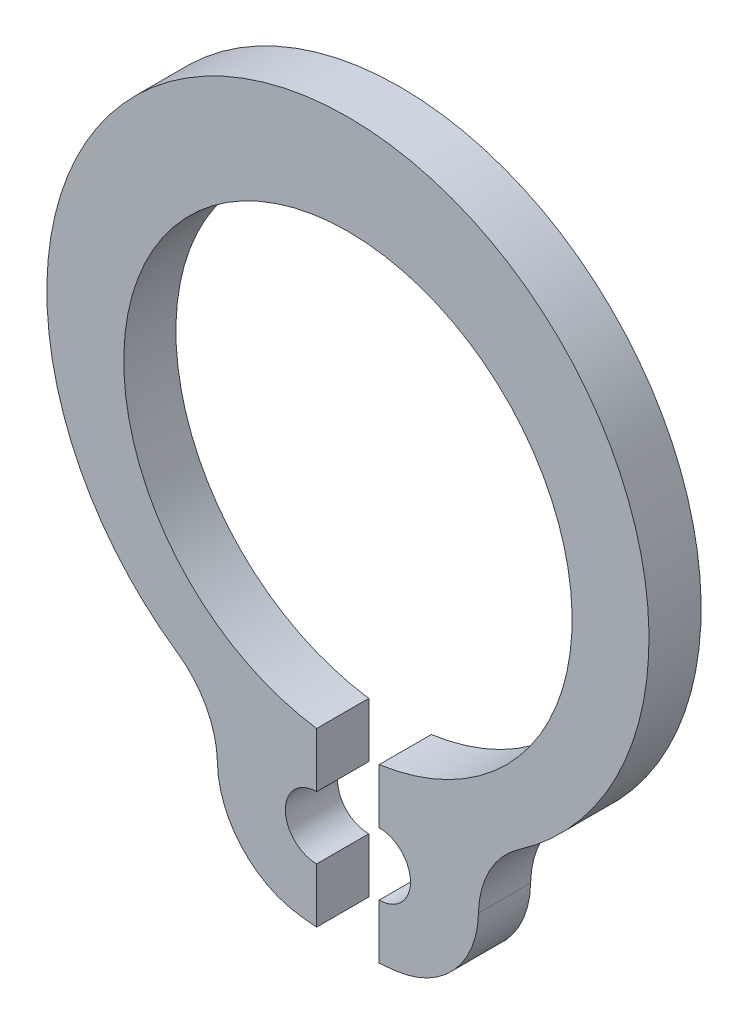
ISO-10303-21;
HEADER;
FILE_DESCRIPTION(('STEP AP214'),'2;1');
FILE_NAME('part.step','',(''),(''),'','','');
FILE_SCHEMA(('AUTOMOTIVE_DESIGN { 1 0 10303 214 1 1 1 1 }'));
ENDSEC;
DATA;
#1=APPLICATION_CONTEXT('core data for automotive mechanical design processes');
#2=APPLICATION_PROTOCOL_DEFINITION('international standard','automotive_design',2000,#1);
#3=PRODUCT_CONTEXT('',#1,'mechanical');
#4=PRODUCT('Part','Part','',(#3));
#5=PRODUCT_RELATED_PRODUCT_CATEGORY('part','',(#4));
#6=PRODUCT_DEFINITION_FORMATION('','',#4);
#7=PRODUCT_DEFINITION_CONTEXT('part definition',#1,'design');
#8=PRODUCT_DEFINITION('design','',#6,#7);
#9=PRODUCT_DEFINITION_SHAPE('','',#8);
#10=(LENGTH_UNIT() NAMED_UNIT(*) SI_UNIT(.MILLI.,.METRE.));
#11=(NAMED_UNIT(*) PLANE_ANGLE_UNIT() SI_UNIT($,.RADIAN.));
#12=(NAMED_UNIT(*) SI_UNIT($,.STERADIAN.) SOLID_ANGLE_UNIT());
#13=UNCERTAINTY_MEASURE_WITH_UNIT(LENGTH_MEASURE(1.E-05),#10,'distance_accuracy_value','');
#14=(GEOMETRIC_REPRESENTATION_CONTEXT(3) GLOBAL_UNCERTAINTY_ASSIGNED_CONTEXT((#13)) GLOBAL_UNIT_ASSIGNED_CONTEXT((#10,
#11,#12)) REPRESENTATION_CONTEXT('',''));
#15=CARTESIAN_POINT('',(0.,0.,0.));
#16=DIRECTION('',(0.,0.,1.));
#17=DIRECTION('',(1.,0.,0.));
#18=AXIS2_PLACEMENT_3D('',#15,#16,#17);
#19=CARTESIAN_POINT('',(0.,-5.55231109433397,0.));
#20=DIRECTION('',(0.,0.,1.));
#21=DIRECTION('',(1.,0.,0.));
#22=AXIS2_PLACEMENT_3D('',#19,#20,#21);
#23=PLANE('',#22);
#24=CARTESIAN_POINT('',(0.,-4.5,0.));
#25=DIRECTION('',(0.,0.,1.));
#26=DIRECTION('',(1.,0.,0.));
#27=AXIS2_PLACEMENT_3D('',#24,#25,#26);
#28=CIRCLE('',#27,7.58171239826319);
#29=CARTESIAN_POINT('',(-0.923332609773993,-12.0252787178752,0.));
#30=VERTEX_POINT('',#29);
#31=CARTESIAN_POINT('',(-0.6,-12.0579337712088,0.));
#32=VERTEX_POINT('',#31);
#33=EDGE_CURVE('E20',#30,#32,#28,.T.);
#34=ORIENTED_EDGE('',*,*,#33,.F.);
#35=CARTESIAN_POINT('',(-0.704121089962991,-10.2386768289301,0.));
#36=DIRECTION('',(0.,0.,1.));
#37=DIRECTION('',(1.,0.,0.));
#38=AXIS2_PLACEMENT_3D('',#35,#36,#37);
#39=CIRCLE('',#38,1.8);
#40=CARTESIAN_POINT('',(-2.50377896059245,-10.2737702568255,0.));
#41=VERTEX_POINT('',#40);
#42=EDGE_CURVE('E119',#41,#30,#39,.T.);
#43=ORIENTED_EDGE('',*,*,#42,.F.);
#44=CARTESIAN_POINT('',(-4.3034368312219,-10.308863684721,0.));
#45=DIRECTION('',(0.,0.,1.));
#46=DIRECTION('',(1.,0.,0.));
#47=AXIS2_PLACEMENT_3D('',#44,#45,#46);
#48=CIRCLE('',#47,1.8);
#49=CARTESIAN_POINT('',(-3.28083798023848,-8.82754954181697,0.));
#50=VERTEX_POINT('',#49);
#51=EDGE_CURVE('E134',#50,#41,#48,.F.);
#52=ORIENTED_EDGE('',*,*,#51,.F.);
#53=CARTESIAN_POINT('',(0.,-4.075,0.));
#54=DIRECTION('',(0.,0.,1.));
#55=DIRECTION('',(1.,0.,0.));
#56=AXIS2_PLACEMENT_3D('',#53,#54,#55);
#57=CIRCLE('',#56,5.775);
#58=CARTESIAN_POINT('',(3.28083798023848,-8.82754954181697,0.));
#59=VERTEX_POINT('',#58);
#60=EDGE_CURVE('E141',#59,#50,#57,.T.);
#61=ORIENTED_EDGE('',*,*,#60,.F.);
#62=CARTESIAN_POINT('',(4.3034368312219,-10.308863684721,0.));
#63=DIRECTION('',(0.,0.,1.));
#64=DIRECTION('',(1.,0.,0.));
#65=AXIS2_PLACEMENT_3D('',#62,#63,#64);
#66=CIRCLE('',#65,1.8);
#67=CARTESIAN_POINT('',(2.50377896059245,-10.2737702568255,0.));
#68=VERTEX_POINT('',#67);
#69=EDGE_CURVE('E144',#68,#59,#66,.F.);
#70=ORIENTED_EDGE('',*,*,#69,.F.);
#71=CARTESIAN_POINT('',(0.704121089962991,-10.2386768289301,0.));
#72=DIRECTION('',(0.,0.,1.));
#73=DIRECTION('',(1.,0.,0.));
#74=AXIS2_PLACEMENT_3D('',#71,#72,#73);
#75=CIRCLE('',#74,1.8);
#76=CARTESIAN_POINT('',(0.923332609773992,-12.0252787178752,0.));
#77=VERTEX_POINT('',#76);
#78=EDGE_CURVE('E147',#77,#68,#75,.T.);
#79=ORIENTED_EDGE('',*,*,#78,.F.);
#80=CARTESIAN_POINT('',(0.,-4.5,0.));
#81=DIRECTION('',(0.,0.,1.));
#82=DIRECTION('',(1.,0.,0.));
#83=AXIS2_PLACEMENT_3D('',#80,#81,#82);
#84=CIRCLE('',#83,7.58171239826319);
#85=CARTESIAN_POINT('',(0.599999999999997,-12.0579337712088,0.));
#86=VERTEX_POINT('',#85);
#87=EDGE_CURVE('E150',#86,#77,#84,.T.);
#88=ORIENTED_EDGE('',*,*,#87,.F.);
#89=DIRECTION('',(0.,-1.,0.));
#90=VECTOR('',#89,1.);
#91=CARTESIAN_POINT('',(0.6,-12.0579337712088,0.));
#92=LINE('',#91,#90);
#93=CARTESIAN_POINT('',(0.6,-11.0079337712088,0.));
#94=VERTEX_POINT('',#93);
#95=EDGE_CURVE('E175',#94,#86,#92,.T.);
#96=ORIENTED_EDGE('',*,*,#95,.F.);
#97=CARTESIAN_POINT('',(0.6,-10.4079337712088,0.));
#98=DIRECTION('',(0.,0.,1.));
#99=DIRECTION('',(1.,0.,0.));
#100=AXIS2_PLACEMENT_3D('',#97,#98,#99);
#101=CIRCLE('',#100,0.6);
#102=CARTESIAN_POINT('',(0.6,-9.80793377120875,0.));
#103=VERTEX_POINT('',#102);
#104=EDGE_CURVE('E153',#103,#94,#101,.F.);
#105=ORIENTED_EDGE('',*,*,#104,.F.);
#106=DIRECTION('',(0.,1.,0.));
#107=VECTOR('',#106,1.);
#108=CARTESIAN_POINT('',(0.6,-9.80793377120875,0.));
#109=LINE('',#108,#107);
#110=CARTESIAN_POINT('',(0.6,-8.75793377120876,0.));
#111=VERTEX_POINT('',#110);
#112=EDGE_CURVE('E177',#111,#103,#109,.F.);
#113=ORIENTED_EDGE('',*,*,#112,.F.);
#114=CARTESIAN_POINT('',(0.,-4.5,0.));
#115=DIRECTION('',(0.,0.,1.));
#116=DIRECTION('',(1.,0.,0.));
#117=AXIS2_PLACEMENT_3D('',#114,#115,#116);
#118=CIRCLE('',#117,4.3);
#119=CARTESIAN_POINT('',(-0.6,-8.75793377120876,0.));
#120=VERTEX_POINT('',#119);
#121=EDGE_CURVE('E157',#120,#111,#118,.F.);
#122=ORIENTED_EDGE('',*,*,#121,.F.);
#123=DIRECTION('',(0.,1.,0.));
#124=VECTOR('',#123,1.);
#125=CARTESIAN_POINT('',(-0.6,-8.75793377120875,0.));
#126=LINE('',#125,#124);
#127=CARTESIAN_POINT('',(-0.6,-9.80793377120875,0.));
#128=VERTEX_POINT('',#127);
#129=EDGE_CURVE('E167',#128,#120,#126,.T.);
#130=ORIENTED_EDGE('',*,*,#129,.F.);
#131=CARTESIAN_POINT('',(-0.6,-10.4079337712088,0.));
#132=DIRECTION('',(0.,0.,1.));
#133=DIRECTION('',(1.,0.,0.));
#134=AXIS2_PLACEMENT_3D('',#131,#132,#133);
#135=CIRCLE('',#134,0.6);
#136=CARTESIAN_POINT('',(-0.6,-11.0079337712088,0.));
#137=VERTEX_POINT('',#136);
#138=EDGE_CURVE('E160',#137,#128,#135,.F.);
#139=ORIENTED_EDGE('',*,*,#138,.F.);
#140=DIRECTION('',(0.,1.,0.));
#141=VECTOR('',#140,1.);
#142=CARTESIAN_POINT('',(-0.6,-11.0079337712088,0.));
#143=LINE('',#142,#141);
#144=EDGE_CURVE('E121',#32,#137,#143,.T.);
#145=ORIENTED_EDGE('',*,*,#144,.F.);
#146=EDGE_LOOP('',(#34,#43,#52,#61,#70,#79,#88,#96,#105,#113,#122,#130,#139,#145));
#147=FACE_BOUND('',#146,.T.);
#148=ADVANCED_FACE('F16',(#147),#23,.F.);
#149=CARTESIAN_POINT('',(0.,-4.5,0.));
#150=DIRECTION('',(0.,0.,1.));
#151=DIRECTION('',(1.,0.,0.));
#152=AXIS2_PLACEMENT_3D('',#149,#150,#151);
#153=CYLINDRICAL_SURFACE('',#152,7.58171239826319);
#154=ORIENTED_EDGE('',*,*,#33,.T.);
#155=DIRECTION('',(0.,0.,-1.));
#156=VECTOR('',#155,1.);
#157=CARTESIAN_POINT('',(-0.6,-12.0579337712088,0.));
#158=LINE('',#157,#156);
#159=CARTESIAN_POINT('',(-0.6,-12.0579337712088,1.));
#160=VERTEX_POINT('',#159);
#161=EDGE_CURVE('E124',#160,#32,#158,.T.);
#162=ORIENTED_EDGE('',*,*,#161,.F.);
#163=CARTESIAN_POINT('',(0.,-4.5,1.));
#164=DIRECTION('',(0.,0.,1.));
#165=DIRECTION('',(1.,0.,0.));
#166=AXIS2_PLACEMENT_3D('',#163,#164,#165);
#167=CIRCLE('',#166,7.58171239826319);
#168=CARTESIAN_POINT('',(-0.923332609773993,-12.0252787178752,1.));
#169=VERTEX_POINT('',#168);
#170=EDGE_CURVE('E129',#169,#160,#167,.T.);
#171=ORIENTED_EDGE('',*,*,#170,.F.);
#172=DIRECTION('',(0.,0.,1.));
#173=VECTOR('',#172,1.);
#174=CARTESIAN_POINT('',(-0.923332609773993,-12.0252787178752,0.));
#175=LINE('',#174,#173);
#176=EDGE_CURVE('E126',#30,#169,#175,.T.);
#177=ORIENTED_EDGE('',*,*,#176,.F.);
#178=EDGE_LOOP('',(#154,#162,#171,#177));
#179=FACE_BOUND('',#178,.T.);
#180=ADVANCED_FACE('F127',(#179),#153,.T.);
#181=CARTESIAN_POINT('',(-0.6,-11.0079337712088,0.));
#182=DIRECTION('',(1.,0.,0.));
#183=DIRECTION('',(0.,0.,-1.));
#184=AXIS2_PLACEMENT_3D('',#181,#182,#183);
#185=PLANE('',#184);
#186=ORIENTED_EDGE('',*,*,#144,.T.);
#187=DIRECTION('',(0.,0.,1.));
#188=VECTOR('',#187,1.);
#189=CARTESIAN_POINT('',(-0.6,-11.0079337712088,0.));
#190=LINE('',#189,#188);
#191=CARTESIAN_POINT('',(-0.6,-11.0079337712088,1.));
#192=VERTEX_POINT('',#191);
#193=EDGE_CURVE('E162',#192,#137,#190,.F.);
#194=ORIENTED_EDGE('',*,*,#193,.F.);
#195=DIRECTION('',(0.,1.,0.));
#196=VECTOR('',#195,1.);
#197=CARTESIAN_POINT('',(-0.6,-5.55231109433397,1.));
#198=LINE('',#197,#196);
#199=EDGE_CURVE('E204',#160,#192,#198,.T.);
#200=ORIENTED_EDGE('',*,*,#199,.F.);
#201=ORIENTED_EDGE('',*,*,#161,.T.);
#202=EDGE_LOOP('',(#186,#194,#200,#201));
#203=FACE_BOUND('',#202,.T.);
#204=ADVANCED_FACE('F286',(#203),#185,.T.);
#205=CARTESIAN_POINT('',(-0.6,-10.4079337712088,0.));
#206=DIRECTION('',(0.,0.,1.));
#207=DIRECTION('',(1.,0.,0.));
#208=AXIS2_PLACEMENT_3D('',#205,#206,#207);
#209=CYLINDRICAL_SURFACE('',#208,0.6);
#210=ORIENTED_EDGE('',*,*,#138,.T.);
#211=DIRECTION('',(0.,0.,-1.));
#212=VECTOR('',#211,1.);
#213=CARTESIAN_POINT('',(-0.6,-9.80793377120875,0.));
#214=LINE('',#213,#212);
#215=CARTESIAN_POINT('',(-0.6,-9.80793377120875,1.));
#216=VERTEX_POINT('',#215);
#217=EDGE_CURVE('E161',#216,#128,#214,.T.);
#218=ORIENTED_EDGE('',*,*,#217,.F.);
#219=CARTESIAN_POINT('',(-0.6,-10.4079337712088,1.));
#220=DIRECTION('',(0.,0.,1.));
#221=DIRECTION('',(1.,0.,0.));
#222=AXIS2_PLACEMENT_3D('',#219,#220,#221);
#223=CIRCLE('',#222,0.6);
#224=EDGE_CURVE('E202',#192,#216,#223,.F.);
#225=ORIENTED_EDGE('',*,*,#224,.F.);
#226=ORIENTED_EDGE('',*,*,#193,.T.);
#227=EDGE_LOOP('',(#210,#218,#225,#226));
#228=FACE_BOUND('',#227,.T.);
#229=ADVANCED_FACE('F283',(#228),#209,.F.);
#230=CARTESIAN_POINT('',(-0.6,-8.75793377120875,0.));
#231=DIRECTION('',(1.,0.,0.));
#232=DIRECTION('',(0.,0.,-1.));
#233=AXIS2_PLACEMENT_3D('',#230,#231,#232);
#234=PLANE('',#233);
#235=ORIENTED_EDGE('',*,*,#129,.T.);
#236=DIRECTION('',(0.,0.,1.));
#237=VECTOR('',#236,1.);
#238=CARTESIAN_POINT('',(-0.6,-8.75793377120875,0.));
#239=LINE('',#238,#237);
#240=CARTESIAN_POINT('',(-0.6,-8.75793377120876,1.));
#241=VERTEX_POINT('',#240);
#242=EDGE_CURVE('E159',#241,#120,#239,.F.);
#243=ORIENTED_EDGE('',*,*,#242,.F.);
#244=DIRECTION('',(0.,1.,0.));
#245=VECTOR('',#244,1.);
#246=CARTESIAN_POINT('',(-0.6,-5.55231109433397,1.));
#247=LINE('',#246,#245);
#248=EDGE_CURVE('E201',#216,#241,#247,.T.);
#249=ORIENTED_EDGE('',*,*,#248,.F.);
#250=ORIENTED_EDGE('',*,*,#217,.T.);
#251=EDGE_LOOP('',(#235,#243,#249,#250));
#252=FACE_BOUND('',#251,.T.);
#253=ADVANCED_FACE('F236',(#252),#234,.T.);
#254=CARTESIAN_POINT('',(0.,-4.5,0.));
#255=DIRECTION('',(0.,0.,1.));
#256=DIRECTION('',(1.,0.,0.));
#257=AXIS2_PLACEMENT_3D('',#254,#255,#256);
#258=CYLINDRICAL_SURFACE('',#257,4.3);
#259=ORIENTED_EDGE('',*,*,#121,.T.);
#260=DIRECTION('',(0.,0.,1.));
#261=VECTOR('',#260,1.);
#262=CARTESIAN_POINT('',(0.6,-8.75793377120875,0.));
#263=LINE('',#262,#261);
#264=CARTESIAN_POINT('',(0.6,-8.75793377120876,1.));
#265=VERTEX_POINT('',#264);
#266=EDGE_CURVE('E158',#265,#111,#263,.F.);
#267=ORIENTED_EDGE('',*,*,#266,.F.);
#268=CARTESIAN_POINT('',(0.,-4.5,1.));
#269=DIRECTION('',(0.,0.,1.));
#270=DIRECTION('',(1.,0.,0.));
#271=AXIS2_PLACEMENT_3D('',#268,#269,#270);
#272=CIRCLE('',#271,4.3);
#273=EDGE_CURVE('E199',#241,#265,#272,.F.);
#274=ORIENTED_EDGE('',*,*,#273,.F.);
#275=ORIENTED_EDGE('',*,*,#242,.T.);
#276=EDGE_LOOP('',(#259,#267,#274,#275));
#277=FACE_BOUND('',#276,.T.);
#278=ADVANCED_FACE('F231',(#277),#258,.F.);
#279=CARTESIAN_POINT('',(0.6,-9.80793377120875,0.));
#280=DIRECTION('',(-1.,0.,0.));
#281=DIRECTION('',(0.,0.,1.));
#282=AXIS2_PLACEMENT_3D('',#279,#280,#281);
#283=PLANE('',#282);
#284=ORIENTED_EDGE('',*,*,#112,.T.);
#285=DIRECTION('',(0.,0.,1.));
#286=VECTOR('',#285,1.);
#287=CARTESIAN_POINT('',(0.6,-9.80793377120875,0.));
#288=LINE('',#287,#286);
#289=CARTESIAN_POINT('',(0.6,-9.80793377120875,1.));
#290=VERTEX_POINT('',#289);
#291=EDGE_CURVE('E156',#290,#103,#288,.F.);
#292=ORIENTED_EDGE('',*,*,#291,.F.);
#293=DIRECTION('',(0.,1.,0.));
#294=VECTOR('',#293,1.);
#295=CARTESIAN_POINT('',(0.6,-5.55231109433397,1.));
#296=LINE('',#295,#294);
#297=EDGE_CURVE('E198',#265,#290,#296,.F.);
#298=ORIENTED_EDGE('',*,*,#297,.F.);
#299=ORIENTED_EDGE('',*,*,#266,.T.);
#300=EDGE_LOOP('',(#284,#292,#298,#299));
#301=FACE_BOUND('',#300,.T.);
#302=ADVANCED_FACE('F241',(#301),#283,.T.);
#303=CARTESIAN_POINT('',(0.6,-10.4079337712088,0.));
#304=DIRECTION('',(0.,0.,1.));
#305=DIRECTION('',(1.,0.,0.));
#306=AXIS2_PLACEMENT_3D('',#303,#304,#305);
#307=CYLINDRICAL_SURFACE('',#306,0.6);
#308=ORIENTED_EDGE('',*,*,#104,.T.);
#309=DIRECTION('',(0.,0.,1.));
#310=VECTOR('',#309,1.);
#311=CARTESIAN_POINT('',(0.6,-11.0079337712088,0.));
#312=LINE('',#311,#310);
#313=CARTESIAN_POINT('',(0.6,-11.0079337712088,1.));
#314=VERTEX_POINT('',#313);
#315=EDGE_CURVE('E155',#314,#94,#312,.F.);
#316=ORIENTED_EDGE('',*,*,#315,.F.);
#317=CARTESIAN_POINT('',(0.6,-10.4079337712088,1.));
#318=DIRECTION('',(0.,0.,1.));
#319=DIRECTION('',(1.,0.,0.));
#320=AXIS2_PLACEMENT_3D('',#317,#318,#319);
#321=CIRCLE('',#320,0.6);
#322=EDGE_CURVE('E195',#290,#314,#321,.F.);
#323=ORIENTED_EDGE('',*,*,#322,.F.);
#324=ORIENTED_EDGE('',*,*,#291,.T.);
#325=EDGE_LOOP('',(#308,#316,#323,#324));
#326=FACE_BOUND('',#325,.T.);
#327=ADVANCED_FACE('F272',(#326),#307,.F.);
#328=CARTESIAN_POINT('',(0.6,-12.0579337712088,0.));
#329=DIRECTION('',(-1.,0.,0.));
#330=DIRECTION('',(0.,-1.,0.));
#331=AXIS2_PLACEMENT_3D('',#328,#329,#330);
#332=PLANE('',#331);
#333=ORIENTED_EDGE('',*,*,#95,.T.);
#334=DIRECTION('',(0.,0.,1.));
#335=VECTOR('',#334,1.);
#336=CARTESIAN_POINT('',(0.599999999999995,-12.0579337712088,0.));
#337=LINE('',#336,#335);
#338=CARTESIAN_POINT('',(0.599999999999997,-12.0579337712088,1.));
#339=VERTEX_POINT('',#338);
#340=EDGE_CURVE('E152',#339,#86,#337,.F.);
#341=ORIENTED_EDGE('',*,*,#340,.F.);
#342=DIRECTION('',(0.,1.,0.));
#343=VECTOR('',#342,1.);
#344=CARTESIAN_POINT('',(0.6,-5.55231109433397,1.));
#345=LINE('',#344,#343);
#346=EDGE_CURVE('E194',#314,#339,#345,.F.);
#347=ORIENTED_EDGE('',*,*,#346,.F.);
#348=ORIENTED_EDGE('',*,*,#315,.T.);
#349=EDGE_LOOP('',(#333,#341,#347,#348));
#350=FACE_BOUND('',#349,.T.);
#351=ADVANCED_FACE('F268',(#350),#332,.T.);
#352=CARTESIAN_POINT('',(0.,-4.5,0.));
#353=DIRECTION('',(0.,0.,1.));
#354=DIRECTION('',(1.,0.,0.));
#355=AXIS2_PLACEMENT_3D('',#352,#353,#354);
#356=CYLINDRICAL_SURFACE('',#355,7.58171239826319);
#357=ORIENTED_EDGE('',*,*,#87,.T.);
#358=DIRECTION('',(0.,0.,1.));
#359=VECTOR('',#358,1.);
#360=CARTESIAN_POINT('',(0.923332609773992,-12.0252787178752,0.));
#361=LINE('',#360,#359);
#362=CARTESIAN_POINT('',(0.923332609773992,-12.0252787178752,1.));
#363=VERTEX_POINT('',#362);
#364=EDGE_CURVE('E149',#363,#77,#361,.F.);
#365=ORIENTED_EDGE('',*,*,#364,.F.);
#366=CARTESIAN_POINT('',(0.,-4.5,1.));
#367=DIRECTION('',(0.,0.,1.));
#368=DIRECTION('',(1.,0.,0.));
#369=AXIS2_PLACEMENT_3D('',#366,#367,#368);
#370=CIRCLE('',#369,7.58171239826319);
#371=EDGE_CURVE('E191',#339,#363,#370,.T.);
#372=ORIENTED_EDGE('',*,*,#371,.F.);
#373=ORIENTED_EDGE('',*,*,#340,.T.);
#374=EDGE_LOOP('',(#357,#365,#372,#373));
#375=FACE_BOUND('',#374,.T.);
#376=ADVANCED_FACE('F264',(#375),#356,.T.);
#377=CARTESIAN_POINT('',(0.704121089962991,-10.2386768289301,0.));
#378=DIRECTION('',(0.,0.,1.));
#379=DIRECTION('',(1.,0.,0.));
#380=AXIS2_PLACEMENT_3D('',#377,#378,#379);
#381=CYLINDRICAL_SURFACE('',#380,1.8);
#382=ORIENTED_EDGE('',*,*,#78,.T.);
#383=DIRECTION('',(0.,0.,1.));
#384=VECTOR('',#383,1.);
#385=CARTESIAN_POINT('',(2.50377896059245,-10.2737702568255,0.));
#386=LINE('',#385,#384);
#387=CARTESIAN_POINT('',(2.50377896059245,-10.2737702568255,1.));
#388=VERTEX_POINT('',#387);
#389=EDGE_CURVE('E146',#388,#68,#386,.F.);
#390=ORIENTED_EDGE('',*,*,#389,.F.);
#391=CARTESIAN_POINT('',(0.704121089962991,-10.2386768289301,1.));
#392=DIRECTION('',(0.,0.,1.));
#393=DIRECTION('',(1.,0.,0.));
#394=AXIS2_PLACEMENT_3D('',#391,#392,#393);
#395=CIRCLE('',#394,1.8);
#396=EDGE_CURVE('E188',#363,#388,#395,.T.);
#397=ORIENTED_EDGE('',*,*,#396,.F.);
#398=ORIENTED_EDGE('',*,*,#364,.T.);
#399=EDGE_LOOP('',(#382,#390,#397,#398));
#400=FACE_BOUND('',#399,.T.);
#401=ADVANCED_FACE('F260',(#400),#381,.T.);
#402=CARTESIAN_POINT('',(4.3034368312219,-10.308863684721,0.));
#403=DIRECTION('',(0.,0.,1.));
#404=DIRECTION('',(1.,0.,0.));
#405=AXIS2_PLACEMENT_3D('',#402,#403,#404);
#406=CYLINDRICAL_SURFACE('',#405,1.8);
#407=ORIENTED_EDGE('',*,*,#69,.T.);
#408=DIRECTION('',(0.,0.,1.));
#409=VECTOR('',#408,1.);
#410=CARTESIAN_POINT('',(3.28083798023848,-8.82754954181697,0.));
#411=LINE('',#410,#409);
#412=CARTESIAN_POINT('',(3.28083798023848,-8.82754954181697,1.));
#413=VERTEX_POINT('',#412);
#414=EDGE_CURVE('E143',#413,#59,#411,.F.);
#415=ORIENTED_EDGE('',*,*,#414,.F.);
#416=CARTESIAN_POINT('',(4.3034368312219,-10.308863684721,1.));
#417=DIRECTION('',(0.,0.,1.));
#418=DIRECTION('',(1.,0.,0.));
#419=AXIS2_PLACEMENT_3D('',#416,#417,#418);
#420=CIRCLE('',#419,1.8);
#421=EDGE_CURVE('E185',#388,#413,#420,.F.);
#422=ORIENTED_EDGE('',*,*,#421,.F.);
#423=ORIENTED_EDGE('',*,*,#389,.T.);
#424=EDGE_LOOP('',(#407,#415,#422,#423));
#425=FACE_BOUND('',#424,.T.);
#426=ADVANCED_FACE('F256',(#425),#406,.F.);
#427=CARTESIAN_POINT('',(0.,-4.075,0.));
#428=DIRECTION('',(0.,0.,1.));
#429=DIRECTION('',(1.,0.,0.));
#430=AXIS2_PLACEMENT_3D('',#427,#428,#429);
#431=CYLINDRICAL_SURFACE('',#430,5.775);
#432=ORIENTED_EDGE('',*,*,#60,.T.);
#433=DIRECTION('',(0.,0.,1.));
#434=VECTOR('',#433,1.);
#435=CARTESIAN_POINT('',(-3.28083798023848,-8.82754954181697,0.));
#436=LINE('',#435,#434);
#437=CARTESIAN_POINT('',(-3.28083798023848,-8.82754954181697,1.));
#438=VERTEX_POINT('',#437);
#439=EDGE_CURVE('E140',#438,#50,#436,.F.);
#440=ORIENTED_EDGE('',*,*,#439,.F.);
#441=CARTESIAN_POINT('',(0.,-4.075,1.));
#442=DIRECTION('',(0.,0.,1.));
#443=DIRECTION('',(1.,0.,0.));
#444=AXIS2_PLACEMENT_3D('',#441,#442,#443);
#445=CIRCLE('',#444,5.775);
#446=EDGE_CURVE('E182',#413,#438,#445,.T.);
#447=ORIENTED_EDGE('',*,*,#446,.F.);
#448=ORIENTED_EDGE('',*,*,#414,.T.);
#449=EDGE_LOOP('',(#432,#440,#447,#448));
#450=FACE_BOUND('',#449,.T.);
#451=ADVANCED_FACE('F251',(#450),#431,.T.);
#452=CARTESIAN_POINT('',(-4.3034368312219,-10.308863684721,0.));
#453=DIRECTION('',(0.,0.,1.));
#454=DIRECTION('',(1.,0.,0.));
#455=AXIS2_PLACEMENT_3D('',#452,#453,#454);
#456=CYLINDRICAL_SURFACE('',#455,1.8);
#457=ORIENTED_EDGE('',*,*,#51,.T.);
#458=DIRECTION('',(0.,0.,1.));
#459=VECTOR('',#458,1.);
#460=CARTESIAN_POINT('',(-2.50377896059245,-10.2737702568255,0.));
#461=LINE('',#460,#459);
#462=CARTESIAN_POINT('',(-2.50377896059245,-10.2737702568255,1.));
#463=VERTEX_POINT('',#462);
#464=EDGE_CURVE('E35',#463,#41,#461,.F.);
#465=ORIENTED_EDGE('',*,*,#464,.F.);
#466=CARTESIAN_POINT('',(-4.3034368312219,-10.308863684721,1.));
#467=DIRECTION('',(0.,0.,1.));
#468=DIRECTION('',(1.,0.,0.));
#469=AXIS2_PLACEMENT_3D('',#466,#467,#468);
#470=CIRCLE('',#469,1.8);
#471=EDGE_CURVE('E26',#438,#463,#470,.F.);
#472=ORIENTED_EDGE('',*,*,#471,.F.);
#473=ORIENTED_EDGE('',*,*,#439,.T.);
#474=EDGE_LOOP('',(#457,#465,#472,#473));
#475=FACE_BOUND('',#474,.T.);
#476=ADVANCED_FACE('F248',(#475),#456,.F.);
#477=CARTESIAN_POINT('',(-0.704121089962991,-10.2386768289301,0.));
#478=DIRECTION('',(0.,0.,1.));
#479=DIRECTION('',(1.,0.,0.));
#480=AXIS2_PLACEMENT_3D('',#477,#478,#479);
#481=CYLINDRICAL_SURFACE('',#480,1.8);
#482=ORIENTED_EDGE('',*,*,#42,.T.);
#483=ORIENTED_EDGE('',*,*,#176,.T.);
#484=CARTESIAN_POINT('',(-0.704121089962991,-10.2386768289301,1.));
#485=DIRECTION('',(0.,0.,1.));
#486=DIRECTION('',(1.,0.,0.));
#487=AXIS2_PLACEMENT_3D('',#484,#485,#486);
#488=CIRCLE('',#487,1.8);
#489=EDGE_CURVE('E10',#463,#169,#488,.T.);
#490=ORIENTED_EDGE('',*,*,#489,.F.);
#491=ORIENTED_EDGE('',*,*,#464,.T.);
#492=EDGE_LOOP('',(#482,#483,#490,#491));
#493=FACE_BOUND('',#492,.T.);
#494=ADVANCED_FACE('F132',(#493),#481,.T.);
#495=CARTESIAN_POINT('',(0.,-5.55231109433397,1.));
#496=DIRECTION('',(0.,0.,1.));
#497=DIRECTION('',(1.,0.,0.));
#498=AXIS2_PLACEMENT_3D('',#495,#496,#497);
#499=PLANE('',#498);
#500=ORIENTED_EDGE('',*,*,#471,.T.);
#501=ORIENTED_EDGE('',*,*,#489,.T.);
#502=ORIENTED_EDGE('',*,*,#170,.T.);
#503=ORIENTED_EDGE('',*,*,#199,.T.);
#504=ORIENTED_EDGE('',*,*,#224,.T.);
#505=ORIENTED_EDGE('',*,*,#248,.T.);
#506=ORIENTED_EDGE('',*,*,#273,.T.);
#507=ORIENTED_EDGE('',*,*,#297,.T.);
#508=ORIENTED_EDGE('',*,*,#322,.T.);
#509=ORIENTED_EDGE('',*,*,#346,.T.);
#510=ORIENTED_EDGE('',*,*,#371,.T.);
#511=ORIENTED_EDGE('',*,*,#396,.T.);
#512=ORIENTED_EDGE('',*,*,#421,.T.);
#513=ORIENTED_EDGE('',*,*,#446,.T.);
#514=EDGE_LOOP('',(#500,#501,#502,#503,#504,#505,#506,#507,#508,#509,#510,#511,#512,#513));
#515=FACE_BOUND('',#514,.T.);
#516=ADVANCED_FACE('F18',(#515),#499,.T.);
#517=CLOSED_SHELL('',(#148,#180,#204,#229,#253,#278,#302,#327,#351,#376,#401,#426,#451,#476,
#494,#516));
#518=MANIFOLD_SOLID_BREP('B1',#517);
#519=ADVANCED_BREP_SHAPE_REPRESENTATION('',(#18,#518),#14);
#520=SHAPE_DEFINITION_REPRESENTATION(#9,#519);
ENDSEC;
END-ISO-10303-21;
